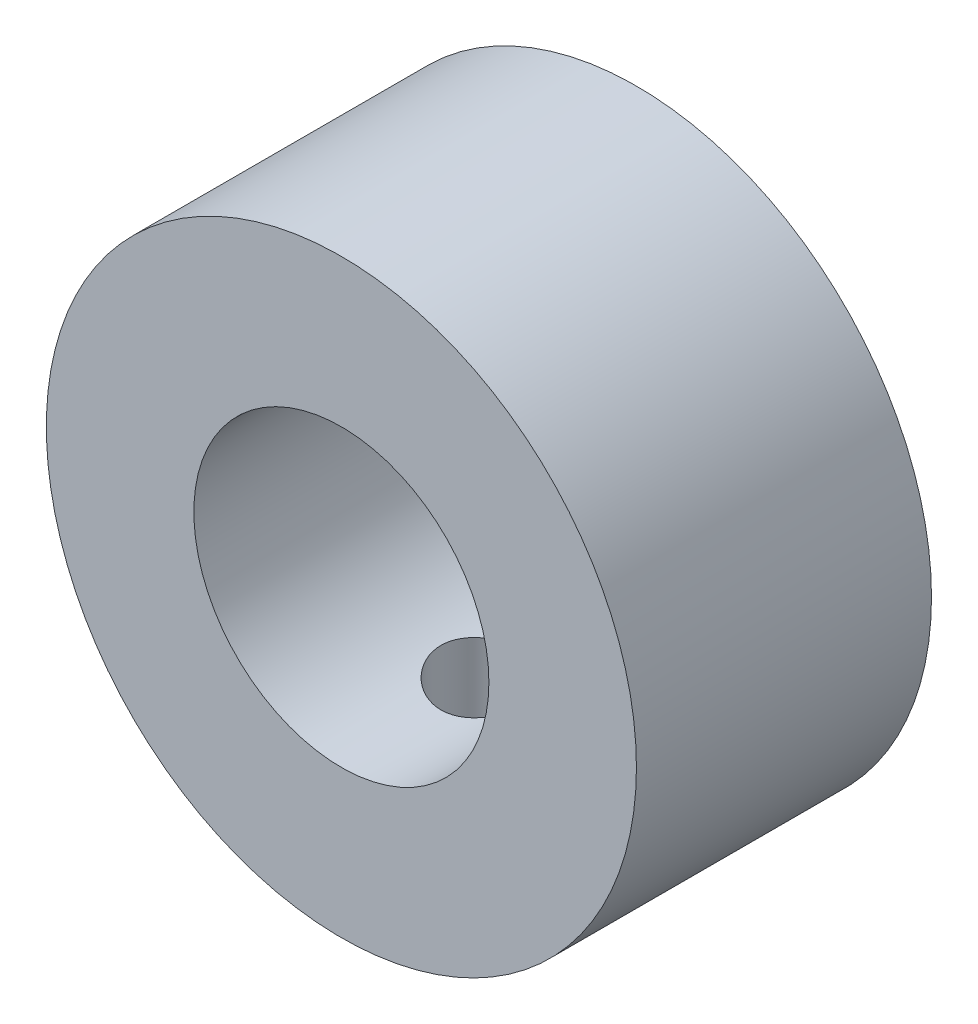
ISO-10303-21;
HEADER;
FILE_DESCRIPTION(('STEP AP214'),'2;1');
FILE_NAME('part.step','',(''),(''),'','','');
FILE_SCHEMA(('AUTOMOTIVE_DESIGN { 1 0 10303 214 1 1 1 1 }'));
ENDSEC;
DATA;
#1=APPLICATION_CONTEXT('core data for automotive mechanical design processes');
#2=APPLICATION_PROTOCOL_DEFINITION('international standard','automotive_design',2000,#1);
#3=PRODUCT_CONTEXT('',#1,'mechanical');
#4=PRODUCT('Part','Part','',(#3));
#5=PRODUCT_RELATED_PRODUCT_CATEGORY('part','',(#4));
#6=PRODUCT_DEFINITION_FORMATION('','',#4);
#7=PRODUCT_DEFINITION_CONTEXT('part definition',#1,'design');
#8=PRODUCT_DEFINITION('design','',#6,#7);
#9=PRODUCT_DEFINITION_SHAPE('','',#8);
#10=(LENGTH_UNIT() NAMED_UNIT(*) SI_UNIT(.MILLI.,.METRE.));
#11=(NAMED_UNIT(*) PLANE_ANGLE_UNIT() SI_UNIT($,.RADIAN.));
#12=(NAMED_UNIT(*) SI_UNIT($,.STERADIAN.) SOLID_ANGLE_UNIT());
#13=UNCERTAINTY_MEASURE_WITH_UNIT(LENGTH_MEASURE(1.E-05),#10,'distance_accuracy_value','');
#14=(GEOMETRIC_REPRESENTATION_CONTEXT(3) GLOBAL_UNCERTAINTY_ASSIGNED_CONTEXT((#13)) GLOBAL_UNIT_ASSIGNED_CONTEXT((#10,
#11,#12)) REPRESENTATION_CONTEXT('',''));
#15=CARTESIAN_POINT('',(0.,0.,0.));
#16=DIRECTION('',(0.,0.,1.));
#17=DIRECTION('',(1.,0.,0.));
#18=AXIS2_PLACEMENT_3D('',#15,#16,#17);
#19=CARTESIAN_POINT('',(0.,0.,20.));
#20=DIRECTION('',(0.,0.,1.));
#21=DIRECTION('',(1.,0.,0.));
#22=AXIS2_PLACEMENT_3D('',#19,#20,#21);
#23=PLANE('',#22);
#24=CARTESIAN_POINT('',(0.,0.,20.));
#25=DIRECTION('',(0.,0.,1.));
#26=DIRECTION('',(1.,0.,0.));
#27=AXIS2_PLACEMENT_3D('',#24,#25,#26);
#28=CIRCLE('',#27,20.);
#29=CARTESIAN_POINT('',(20.,0.,20.));
#30=VERTEX_POINT('',#29);
#31=EDGE_CURVE('E10',#30,#30,#28,.T.);
#32=ORIENTED_EDGE('',*,*,#31,.T.);
#33=EDGE_LOOP('',(#32));
#34=FACE_BOUND('',#33,.T.);
#35=CARTESIAN_POINT('',(0.,0.,20.));
#36=DIRECTION('',(0.,0.,1.));
#37=DIRECTION('',(1.,0.,0.));
#38=AXIS2_PLACEMENT_3D('',#35,#36,#37);
#39=CIRCLE('',#38,10.);
#40=CARTESIAN_POINT('',(10.,0.,20.));
#41=VERTEX_POINT('',#40);
#42=EDGE_CURVE('E44',#41,#41,#39,.T.);
#43=ORIENTED_EDGE('',*,*,#42,.F.);
#44=EDGE_LOOP('',(#43));
#45=FACE_BOUND('',#44,.T.);
#46=ADVANCED_FACE('F27',(#34,#45),#23,.T.);
#47=CARTESIAN_POINT('',(0.,0.,0.));
#48=DIRECTION('',(0.,0.,1.));
#49=DIRECTION('',(1.,0.,0.));
#50=AXIS2_PLACEMENT_3D('',#47,#48,#49);
#51=PLANE('',#50);
#52=CARTESIAN_POINT('',(0.,0.,0.));
#53=DIRECTION('',(0.,0.,1.));
#54=DIRECTION('',(1.,0.,0.));
#55=AXIS2_PLACEMENT_3D('',#52,#53,#54);
#56=CIRCLE('',#55,20.);
#57=CARTESIAN_POINT('',(20.,0.,0.));
#58=VERTEX_POINT('',#57);
#59=EDGE_CURVE('E40',#58,#58,#56,.T.);
#60=ORIENTED_EDGE('',*,*,#59,.F.);
#61=EDGE_LOOP('',(#60));
#62=FACE_BOUND('',#61,.T.);
#63=CARTESIAN_POINT('',(0.,0.,0.));
#64=DIRECTION('',(0.,0.,1.));
#65=DIRECTION('',(1.,0.,0.));
#66=AXIS2_PLACEMENT_3D('',#63,#64,#65);
#67=CIRCLE('',#66,10.);
#68=CARTESIAN_POINT('',(10.,0.,0.));
#69=VERTEX_POINT('',#68);
#70=EDGE_CURVE('E49',#69,#69,#67,.T.);
#71=ORIENTED_EDGE('',*,*,#70,.T.);
#72=EDGE_LOOP('',(#71));
#73=FACE_BOUND('',#72,.T.);
#74=ADVANCED_FACE('F66',(#62,#73),#51,.F.);
#75=CARTESIAN_POINT('',(0.,0.,20.));
#76=DIRECTION('',(0.,0.,-1.));
#77=DIRECTION('',(-1.,0.,0.));
#78=AXIS2_PLACEMENT_3D('',#75,#76,#77);
#79=CYLINDRICAL_SURFACE('',#78,20.);
#80=CARTESIAN_POINT('',(0.,-20.,13.25));
#81=CARTESIAN_POINT('',(0.181273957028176,-19.9999969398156,13.2499926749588));
#82=CARTESIAN_POINT('',(0.362648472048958,-19.9975097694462,13.2347825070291));
#83=CARTESIAN_POINT('',(0.72031500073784,-19.9878274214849,13.1743664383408));
#84=CARTESIAN_POINT('',(0.89660210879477,-19.9806278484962,13.1291325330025));
#85=CARTESIAN_POINT('',(1.23886699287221,-19.9623286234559,13.0100670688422));
#86=CARTESIAN_POINT('',(1.40485291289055,-19.9512320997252,12.9362584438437));
#87=CARTESIAN_POINT('',(1.72206205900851,-19.9263606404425,12.7621977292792));
#88=CARTESIAN_POINT('',(1.87328706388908,-19.9125860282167,12.6619488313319));
#89=CARTESIAN_POINT('',(2.15808118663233,-19.8837463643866,12.4368816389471));
#90=CARTESIAN_POINT('',(2.29149636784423,-19.8686717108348,12.3118697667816));
#91=CARTESIAN_POINT('',(2.53555436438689,-19.8390048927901,12.0412419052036));
#92=CARTESIAN_POINT('',(2.646195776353,-19.8244127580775,11.8956246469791));
#93=CARTESIAN_POINT('',(2.8421779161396,-19.7972701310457,11.5868680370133));
#94=CARTESIAN_POINT('',(2.92736726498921,-19.7847320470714,11.4236314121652));
#95=CARTESIAN_POINT('',(3.06905919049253,-19.7632498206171,11.0849278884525));
#96=CARTESIAN_POINT('',(3.12556360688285,-19.7543054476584,10.9094617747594));
#97=CARTESIAN_POINT('',(3.20779847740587,-19.7411186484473,10.5529086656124));
#98=CARTESIAN_POINT('',(3.23379413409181,-19.7368357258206,10.3718843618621));
#99=CARTESIAN_POINT('',(3.25509564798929,-19.7333341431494,10.0079964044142));
#100=CARTESIAN_POINT('',(3.25040357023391,-19.7341151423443,9.8251328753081));
#101=CARTESIAN_POINT('',(3.21067900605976,-19.7406161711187,9.46464530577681));
#102=CARTESIAN_POINT('',(3.17594377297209,-19.7462878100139,9.28698750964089));
#103=CARTESIAN_POINT('',(3.07758509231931,-19.7618553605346,8.94005543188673));
#104=CARTESIAN_POINT('',(3.01396069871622,-19.7717514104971,8.77078142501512));
#105=CARTESIAN_POINT('',(2.85932637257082,-19.7947053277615,8.44452834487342));
#106=CARTESIAN_POINT('',(2.76819236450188,-19.8077774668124,8.28760912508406));
#107=CARTESIAN_POINT('',(2.56121393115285,-19.8356006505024,7.99117755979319));
#108=CARTESIAN_POINT('',(2.44536760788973,-19.8503518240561,7.85166655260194));
#109=CARTESIAN_POINT('',(2.19063027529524,-19.8800839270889,7.59229041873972));
#110=CARTESIAN_POINT('',(2.05148408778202,-19.8950655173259,7.47267584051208));
#111=CARTESIAN_POINT('',(1.7549616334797,-19.9234097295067,7.25845606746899));
#112=CARTESIAN_POINT('',(1.59758525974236,-19.9367723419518,7.1638510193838));
#113=CARTESIAN_POINT('',(1.26883897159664,-19.9603906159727,7.0023155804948));
#114=CARTESIAN_POINT('',(1.09745835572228,-19.9706438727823,6.93540659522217));
#115=CARTESIAN_POINT('',(0.745688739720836,-19.986868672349,6.83139127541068));
#116=CARTESIAN_POINT('',(0.56530045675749,-19.992840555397,6.79428257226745));
#117=CARTESIAN_POINT('',(0.20279631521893,-19.9997841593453,6.75125916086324));
#118=CARTESIAN_POINT('',(0.0207223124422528,-20.000811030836,6.74500037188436));
#119=CARTESIAN_POINT('',(-0.341873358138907,-19.997899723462,6.76293816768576));
#120=CARTESIAN_POINT('',(-0.522395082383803,-19.9939617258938,6.78713364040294));
#121=CARTESIAN_POINT('',(-0.875704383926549,-19.9815972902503,6.86500696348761));
#122=CARTESIAN_POINT('',(-1.04853033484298,-19.9731966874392,6.91851516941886));
#123=CARTESIAN_POINT('',(-1.38275843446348,-19.9528453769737,7.05331471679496));
#124=CARTESIAN_POINT('',(-1.544159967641,-19.9408944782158,7.13460755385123));
#125=CARTESIAN_POINT('',(-1.85245699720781,-19.9146320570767,7.32346178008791));
#126=CARTESIAN_POINT('',(-1.99921864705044,-19.9003014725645,7.43123896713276));
#127=CARTESIAN_POINT('',(-2.27269511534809,-19.8709287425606,7.6697047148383));
#128=CARTESIAN_POINT('',(-2.39940855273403,-19.8558865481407,7.80039485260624));
#129=CARTESIAN_POINT('',(-2.63046104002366,-19.8266085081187,8.08251697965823));
#130=CARTESIAN_POINT('',(-2.73456807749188,-19.8123820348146,8.2341401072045));
#131=CARTESIAN_POINT('',(-2.9158341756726,-19.786518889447,8.55292441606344));
#132=CARTESIAN_POINT('',(-2.99299405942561,-19.7748821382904,8.72008512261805));
#133=CARTESIAN_POINT('',(-3.11782528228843,-19.7555856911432,9.0645396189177));
#134=CARTESIAN_POINT('',(-3.16561381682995,-19.7479102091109,9.24179001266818));
#135=CARTESIAN_POINT('',(-3.23071574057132,-19.7373651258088,9.60193657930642));
#136=CARTESIAN_POINT('',(-3.24803163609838,-19.7344951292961,9.78483228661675));
#137=CARTESIAN_POINT('',(-3.25162950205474,-19.7339024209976,10.1487620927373));
#138=CARTESIAN_POINT('',(-3.23827655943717,-19.7361191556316,10.3297925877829));
#139=CARTESIAN_POINT('',(-3.18170339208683,-19.7453177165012,10.6869952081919));
#140=CARTESIAN_POINT('',(-3.13848325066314,-19.7522995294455,10.8631673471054));
#141=CARTESIAN_POINT('',(-3.02353965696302,-19.7702190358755,11.2055215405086));
#142=CARTESIAN_POINT('',(-2.95184611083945,-19.7811525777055,11.3717138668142));
#143=CARTESIAN_POINT('',(-2.78202798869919,-19.8057478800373,11.6897707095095));
#144=CARTESIAN_POINT('',(-2.68390220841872,-19.8194097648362,11.8416345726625));
#145=CARTESIAN_POINT('',(-2.46269595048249,-19.8481150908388,12.1285709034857));
#146=CARTESIAN_POINT('',(-2.33934639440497,-19.863172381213,12.2634345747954));
#147=CARTESIAN_POINT('',(-2.0717619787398,-19.8928601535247,12.5106750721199));
#148=CARTESIAN_POINT('',(-1.92752229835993,-19.9074905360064,12.6230466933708));
#149=CARTESIAN_POINT('',(-1.62113451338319,-19.9347864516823,12.8227807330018));
#150=CARTESIAN_POINT('',(-1.45887555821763,-19.9474385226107,12.9099749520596));
#151=CARTESIAN_POINT('',(-1.12187726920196,-19.9692210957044,13.055736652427));
#152=CARTESIAN_POINT('',(-0.947150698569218,-19.9783551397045,13.1143329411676));
#153=CARTESIAN_POINT('',(-0.643097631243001,-19.9900553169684,13.188367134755));
#154=CARTESIAN_POINT('',(-0.51562065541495,-19.9937648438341,13.211442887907));
#155=CARTESIAN_POINT('',(-0.258779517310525,-19.9987382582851,13.2422618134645));
#156=CARTESIAN_POINT('',(-0.129415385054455,-20.0000021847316,13.2500052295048));
#157=CARTESIAN_POINT('',(0.,-20.,13.25));
#158=B_SPLINE_CURVE_WITH_KNOTS('',3,(#80,#81,#82,#83,#84,#85,#86,#87,#88,#89,#90,#91,#92,#93,
#94,#95,#96,#97,#98,#99,#100,#101,#102,#103,#104,#105,#106,#107,#108,#109,#110,#111,#112,#113,
#114,#115,#116,#117,#118,#119,#120,#121,#122,#123,#124,#125,#126,#127,#128,#129,#130,#131,#132,
#133,#134,#135,#136,#137,#138,#139,#140,#141,#142,#143,#144,#145,#146,#147,#148,#149,#150,#151,
#152,#153,#154,#155,#156,#157),.UNSPECIFIED.,.T.,.F.,(4,2,2,2,2,2,2,2,2,2,2,2,2,2,2,2,2,2,2,2,2,
2,2,2,2,2,2,2,2,2,2,2,2,2,2,2,2,2,4),(0.,0.543348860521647,1.08720524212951,1.63062603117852,
2.17398125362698,2.72176472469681,3.26958194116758,3.82059530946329,4.37157333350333,
4.91772555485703,5.46384102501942,6.00461413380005,6.54540495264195,7.08867227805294,
7.6319813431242,8.18168490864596,8.73139169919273,9.2815225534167,9.8316096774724,
10.3755473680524,10.9194651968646,11.4602679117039,12.0010997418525,12.5464936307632,
13.0919250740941,13.6427143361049,14.1934867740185,14.7420470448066,15.2905621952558,
15.8325816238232,16.3745995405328,16.9160496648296,17.4575244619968,18.005108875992,
18.5528198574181,19.1041094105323,19.6548424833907,20.0427571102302,20.4306655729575),.UNSPECIFIED.);
#159=CARTESIAN_POINT('',(0.,-20.,13.25));
#160=VERTEX_POINT('',#159);
#161=EDGE_CURVE('E52',#160,#160,#158,.T.);
#162=ORIENTED_EDGE('',*,*,#161,.T.);
#163=EDGE_LOOP('',(#162));
#164=FACE_BOUND('',#163,.T.);
#165=ORIENTED_EDGE('',*,*,#31,.F.);
#166=EDGE_LOOP('',(#165));
#167=FACE_BOUND('',#166,.T.);
#168=ORIENTED_EDGE('',*,*,#59,.T.);
#169=EDGE_LOOP('',(#168));
#170=FACE_BOUND('',#169,.T.);
#171=ADVANCED_FACE('F29',(#164,#167,#170),#79,.T.);
#172=CARTESIAN_POINT('',(0.,0.,20.));
#173=DIRECTION('',(0.,0.,-1.));
#174=DIRECTION('',(-1.,0.,0.));
#175=AXIS2_PLACEMENT_3D('',#172,#173,#174);
#176=CYLINDRICAL_SURFACE('',#175,10.);
#177=CARTESIAN_POINT('',(0.,-10.,13.25));
#178=CARTESIAN_POINT('',(0.177579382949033,-9.99999989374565,13.2499999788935));
#179=CARTESIAN_POINT('',(0.355160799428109,-9.99522579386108,13.2353980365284));
#180=CARTESIAN_POINT('',(0.70510811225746,-9.97665017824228,13.1775443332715));
#181=CARTESIAN_POINT('',(0.877473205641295,-9.96284727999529,13.1342881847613));
#182=CARTESIAN_POINT('',(1.21189182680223,-9.92771716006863,13.0207547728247));
#183=CARTESIAN_POINT('',(1.37396158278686,-9.90640214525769,12.9505213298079));
#184=CARTESIAN_POINT('',(1.684022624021,-9.85843361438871,12.7852203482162));
#185=CARTESIAN_POINT('',(1.83201134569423,-9.83177912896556,12.6901482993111));
#186=CARTESIAN_POINT('',(2.11461081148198,-9.77495932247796,12.4745589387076));
#187=CARTESIAN_POINT('',(2.24869037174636,-9.74471295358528,12.3533668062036));
#188=CARTESIAN_POINT('',(2.49502344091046,-9.6845736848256,12.0904130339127));
#189=CARTESIAN_POINT('',(2.6072724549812,-9.65468085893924,11.9486471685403));
#190=CARTESIAN_POINT('',(2.80972801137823,-9.59775056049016,11.6438629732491));
#191=CARTESIAN_POINT('',(2.89925504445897,-9.57081237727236,11.4803729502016));
#192=CARTESIAN_POINT('',(3.049318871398,-9.52406830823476,11.1396400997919));
#193=CARTESIAN_POINT('',(3.10986401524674,-9.50426036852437,10.9624012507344));
#194=CARTESIAN_POINT('',(3.19827260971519,-9.4748706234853,10.6052240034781));
#195=CARTESIAN_POINT('',(3.2271274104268,-9.46497952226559,10.4255571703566));
#196=CARTESIAN_POINT('',(3.25443459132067,-9.45562707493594,10.0636810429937));
#197=CARTESIAN_POINT('',(3.25289582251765,-9.45616269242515,9.88147250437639));
#198=CARTESIAN_POINT('',(3.22023155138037,-9.46733131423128,9.52803492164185));
#199=CARTESIAN_POINT('',(3.19038591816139,-9.47752750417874,9.3566714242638));
#200=CARTESIAN_POINT('',(3.10403782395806,-9.50615574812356,9.02153026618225));
#201=CARTESIAN_POINT('',(3.04753231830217,-9.52458874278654,8.85775347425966));
#202=CARTESIAN_POINT('',(2.9086040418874,-9.56793440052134,8.53946972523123));
#203=CARTESIAN_POINT('',(2.82579288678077,-9.5929431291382,8.38514594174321));
#204=CARTESIAN_POINT('',(2.63687365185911,-9.64658062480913,8.09217407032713));
#205=CARTESIAN_POINT('',(2.53075911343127,-9.6752103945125,7.95353034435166));
#206=CARTESIAN_POINT('',(2.29204406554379,-9.73459644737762,7.68864419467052));
#207=CARTESIAN_POINT('',(2.15839298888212,-9.76538786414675,7.56335456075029));
#208=CARTESIAN_POINT('',(1.87159594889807,-9.82438470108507,7.33672493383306));
#209=CARTESIAN_POINT('',(1.71844829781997,-9.85258989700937,7.23538701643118));
#210=CARTESIAN_POINT('',(1.3950599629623,-9.90357541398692,7.05882041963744));
#211=CARTESIAN_POINT('',(1.22467751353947,-9.92630448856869,6.98383558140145));
#212=CARTESIAN_POINT('',(0.872803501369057,-9.96340575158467,6.86388245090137));
#213=CARTESIAN_POINT('',(0.691315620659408,-9.97778069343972,6.81890426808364));
#214=CARTESIAN_POINT('',(0.330457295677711,-9.99610319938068,6.76190268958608));
#215=CARTESIAN_POINT('',(0.151310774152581,-10.0004581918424,6.74859087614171));
#216=CARTESIAN_POINT('',(-0.206684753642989,-9.99946515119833,6.75164499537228));
#217=CARTESIAN_POINT('',(-0.385533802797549,-9.99411866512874,6.76800619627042));
#218=CARTESIAN_POINT('',(-0.732777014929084,-9.97459190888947,6.82891612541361));
#219=CARTESIAN_POINT('',(-0.901323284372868,-9.96065655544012,6.87268387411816));
#220=CARTESIAN_POINT('',(-1.22862125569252,-9.92560343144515,6.98619763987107));
#221=CARTESIAN_POINT('',(-1.38737171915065,-9.90448475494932,7.05594693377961));
#222=CARTESIAN_POINT('',(-1.69509055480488,-9.85654869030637,7.2214272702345));
#223=CARTESIAN_POINT('',(-1.84370519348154,-9.82959944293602,7.3177768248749));
#224=CARTESIAN_POINT('',(-2.12308150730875,-9.77306882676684,7.53298990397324));
#225=CARTESIAN_POINT('',(-2.25383795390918,-9.74348669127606,7.651859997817));
#226=CARTESIAN_POINT('',(-2.49964097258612,-9.68341394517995,7.91480097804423));
#227=CARTESIAN_POINT('',(-2.61376838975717,-9.65293908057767,8.05973674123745));
#228=CARTESIAN_POINT('',(-2.81618275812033,-9.59584349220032,8.36736100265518));
#229=CARTESIAN_POINT('',(-2.90446977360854,-9.56922275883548,8.53004945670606));
#230=CARTESIAN_POINT('',(-3.05222465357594,-9.52312626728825,8.86845253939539));
#231=CARTESIAN_POINT('',(-3.11177462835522,-9.50363019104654,9.04412838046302));
#232=CARTESIAN_POINT('',(-3.20020095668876,-9.47422438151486,9.40378778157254));
#233=CARTESIAN_POINT('',(-3.22909023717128,-9.4643106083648,9.58776780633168));
#234=CARTESIAN_POINT('',(-3.25439854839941,-9.45563586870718,9.94914011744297));
#235=CARTESIAN_POINT('',(-3.25233581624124,-9.45635339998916,10.1264147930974));
#236=CARTESIAN_POINT('',(-3.21950614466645,-9.46758016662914,10.4779539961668));
#237=CARTESIAN_POINT('',(-3.18874075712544,-9.47808887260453,10.6522186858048));
#238=CARTESIAN_POINT('',(-3.10043070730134,-9.50733511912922,10.9898321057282));
#239=CARTESIAN_POINT('',(-3.04335434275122,-9.52592844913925,11.1533167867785));
#240=CARTESIAN_POINT('',(-2.90441722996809,-9.5692021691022,11.4685171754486));
#241=CARTESIAN_POINT('',(-2.82255115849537,-9.59388386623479,11.6202303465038));
#242=CARTESIAN_POINT('',(-2.63235879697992,-9.64784088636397,11.9144561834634));
#243=CARTESIAN_POINT('',(-2.52306891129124,-9.67726517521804,12.0563185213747));
#244=CARTESIAN_POINT('',(-2.28278717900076,-9.73674387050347,12.3201809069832));
#245=CARTESIAN_POINT('',(-2.15178933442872,-9.76679844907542,12.4421754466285));
#246=CARTESIAN_POINT('',(-1.86608754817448,-9.8254625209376,12.6672967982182));
#247=CARTESIAN_POINT('',(-1.71069498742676,-9.85397977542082,12.7695765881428));
#248=CARTESIAN_POINT('',(-1.38400159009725,-9.90514098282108,12.9464406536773));
#249=CARTESIAN_POINT('',(-1.21270574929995,-9.92778677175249,13.0210335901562));
#250=CARTESIAN_POINT('',(-0.869832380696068,-9.96349655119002,13.1363330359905));
#251=CARTESIAN_POINT('',(-0.698908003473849,-9.97706030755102,13.1788273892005));
#252=CARTESIAN_POINT('',(-0.351988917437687,-9.9953110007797,13.2356574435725));
#253=CARTESIAN_POINT('',(-0.175995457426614,-10.0000001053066,13.2500000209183));
#254=CARTESIAN_POINT('',(0.,-10.,13.25));
#255=B_SPLINE_CURVE_WITH_KNOTS('',3,(#177,#178,#179,#180,#181,#182,#183,#184,#185,#186,#187,
#188,#189,#190,#191,#192,#193,#194,#195,#196,#197,#198,#199,#200,#201,#202,#203,#204,#205,#206,
#207,#208,#209,#210,#211,#212,#213,#214,#215,#216,#217,#218,#219,#220,#221,#222,#223,#224,#225,
#226,#227,#228,#229,#230,#231,#232,#233,#234,#235,#236,#237,#238,#239,#240,#241,#242,#243,#244,
#245,#246,#247,#248,#249,#250,#251,#252,#253,#254),.UNSPECIFIED.,.T.,.F.,(4,2,2,2,2,2,2,2,2,2,2,
2,2,2,2,2,2,2,2,2,2,2,2,2,2,2,2,2,2,2,2,2,2,2,2,2,2,2,4),(0.,0.532090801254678,1.06426309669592,
1.59557459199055,2.12698263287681,2.67425296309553,3.22163585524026,3.78384740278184,
4.34589687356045,4.88981368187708,5.43357209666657,5.95386117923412,6.47420969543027,
7.0026288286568,7.53119460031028,8.08590846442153,8.64067038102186,9.2004380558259,
9.76002113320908,10.2964148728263,10.8327230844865,11.3544036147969,11.8761499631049,
12.4112318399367,12.9464700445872,13.5047604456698,14.0630494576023,14.6197336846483,
15.176183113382,15.7054311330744,16.2346505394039,16.7547941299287,17.275049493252,
17.8170673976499,18.3592353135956,18.9211107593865,19.4828102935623,20.0102839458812,
20.5376287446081),.UNSPECIFIED.);
#256=CARTESIAN_POINT('',(0.,-10.,13.25));
#257=VERTEX_POINT('',#256);
#258=EDGE_CURVE('E32',#257,#257,#255,.T.);
#259=ORIENTED_EDGE('',*,*,#258,.F.);
#260=EDGE_LOOP('',(#259));
#261=FACE_BOUND('',#260,.T.);
#262=ORIENTED_EDGE('',*,*,#42,.T.);
#263=EDGE_LOOP('',(#262));
#264=FACE_BOUND('',#263,.T.);
#265=ORIENTED_EDGE('',*,*,#70,.F.);
#266=EDGE_LOOP('',(#265));
#267=FACE_BOUND('',#266,.T.);
#268=ADVANCED_FACE('F59',(#261,#264,#267),#176,.F.);
#269=CARTESIAN_POINT('',(0.,-25.,10.));
#270=DIRECTION('',(0.,1.,0.));
#271=DIRECTION('',(0.,0.,1.));
#272=AXIS2_PLACEMENT_3D('',#269,#270,#271);
#273=CYLINDRICAL_SURFACE('',#272,3.25);
#274=ORIENTED_EDGE('',*,*,#258,.T.);
#275=EDGE_LOOP('',(#274));
#276=FACE_BOUND('',#275,.T.);
#277=ORIENTED_EDGE('',*,*,#161,.F.);
#278=EDGE_LOOP('',(#277));
#279=FACE_BOUND('',#278,.T.);
#280=ADVANCED_FACE('F56',(#276,#279),#273,.F.);
#281=CLOSED_SHELL('',(#46,#74,#171,#268,#280));
#282=MANIFOLD_SOLID_BREP('B2',#281);
#283=ADVANCED_BREP_SHAPE_REPRESENTATION('',(#18,#282),#14);
#284=SHAPE_DEFINITION_REPRESENTATION(#9,#283);
ENDSEC;
END-ISO-10303-21;
